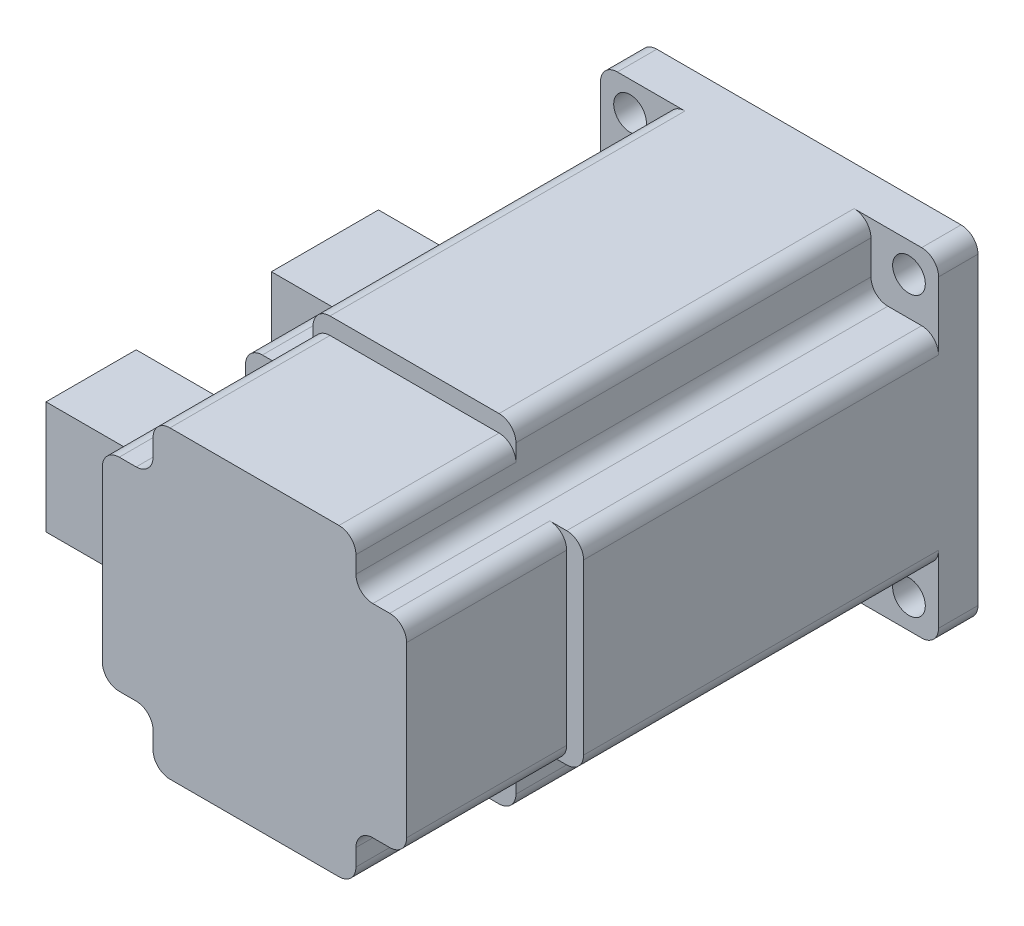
from build123d import *

# Parameters (mm, degrees)
EXTRUDE_1_DEPTH     = 91.4
SKETCH_2_OUTSIDE_W  = 86.944
SKETCH_2_OUTSIDE_H  = 86.944
CUT_EXTRUDE_1_DEPTH = 28.4
EXTRUDE_2_DEPTH     = 7
SKETCH_4_R          = 2.9
CUT_EXTRUDE_2_DEPTH = 7
SKETCH_5_W          = 19
SKETCH_5_H          = 20
SKETCH_5_W_2        = 16
EXTRUDE_3_DEPTH     = 17


with BuildPart() as part:
    # Sketch 1 → Extrude 1 (new body)
    with BuildSketch(Plane.XY):
        with BuildLine():
            Line((23.999999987, -18.000000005), (27, -18.000000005))
            ThreePointArc((27, -18.000000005), (29.121320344, -17.121320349), (30.000000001, -15.000000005))
            Line((30.000000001, -15.000000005), (30.000000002, 15.000000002))
            ThreePointArc((30.000000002, 15.000000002), (29.121320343, 17.121320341), (27.000000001, 17.999999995))
            Line((27.000000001, 17.999999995), (24.000000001, 17.999999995))
            Line((24.000000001, 17.999999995), (21.000000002, 17.999999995))
            ThreePointArc((21.000000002, 17.999999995), (18.878679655, 18.878679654), (18.000000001, 21.000000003))
            Line((18.000000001, 21.000000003), (18.000000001, 23.999999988))
            Line((18.000000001, 23.999999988), (18.000000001, 27))
            ThreePointArc((18.000000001, 27), (17.121320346, 29.121320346), (15.000000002, 30.000000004))
            Line((15.000000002, 30.000000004), (-15.000000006, 30.000000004))
            ThreePointArc((-15.000000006, 30.000000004), (-17.121320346, 29.121320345), (-18.000000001, 27.000000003))
            Line((-18.000000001, 27.000000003), (-18.000000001, 24))
            Line((-18.000000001, 24), (-18.000000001, 21.000000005))
            ThreePointArc((-18.000000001, 21.000000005), (-18.878679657, 18.87867966), (-21.000000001, 18.000000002))
            Line((-21.000000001, 18.000000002), (-23.999999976, 18.000000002))
            Line((-23.999999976, 18.000000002), (-26.999999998, 18.000000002))
            ThreePointArc((-26.999999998, 18.000000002), (-29.121320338, 17.121320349), (-29.999999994, 15.00000001))
            Line((-29.999999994, 15.00000001), (-29.999999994, -15.000000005))
            ThreePointArc((-29.999999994, -15.000000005), (-29.121320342, -17.121320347), (-27, -18.000000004))
            Line((-27, -18.000000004), (-24.000000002, -18.000000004))
            Line((-24.000000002, -18.000000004), (-21.000000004, -18.000000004))
            ThreePointArc((-21.000000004, -18.000000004), (-18.878679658, -18.87867966), (-18.000000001, -21.000000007))
            Line((-18.000000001, -21.000000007), (-18.000000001, -24.000000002))
            Line((-18.000000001, -24.000000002), (-18.000000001, -27.000000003))
            ThreePointArc((-18.000000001, -27.000000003), (-17.121320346, -29.121320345), (-15.000000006, -30.000000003))
            Line((-15.000000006, -30.000000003), (15.000000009, -30.000000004))
            ThreePointArc((15.000000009, -30.000000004), (17.121320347, -29.121320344), (18.000000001, -27.000000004))
            Line((18.000000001, -27.000000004), (18.000000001, -24.000000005))
            Line((18.000000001, -24.000000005), (18.000000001, -21.000000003))
            ThreePointArc((18.000000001, -21.000000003), (18.878679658, -18.878679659), (21.000000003, -18.000000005))
            Line((21.000000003, -18.000000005), (23.999999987, -18.000000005))
        make_face()
    extrude(amount=EXTRUDE_1_DEPTH)

    # Sketch 2 outside → Cut-Extrude 1 (cut)
    with BuildSketch(Plane.XY.offset(91.4)):
        Rectangle(SKETCH_2_OUTSIDE_W, SKETCH_2_OUTSIDE_H)
        with BuildLine():
            Line((-15.000000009, -27.000000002), (15.000000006, -27.000000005))
            ThreePointArc((15.000000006, -27.000000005), (17.121320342, -26.121320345), (17.999999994, -24.000000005))
            Line((17.999999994, -24.000000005), (17.999999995, -21.000000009))
            ThreePointArc((17.999999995, -21.000000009), (18.878679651, -18.878679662), (20.999999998, -18.000000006))
            Line((20.999999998, -18.000000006), (23.999999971, -18.000000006))
            ThreePointArc((23.999999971, -18.000000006), (26.121320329, -17.12132036), (26.999999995, -15.00000001))
            Line((26.999999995, -15.00000001), (26.999999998, 15.000000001))
            ThreePointArc((26.999999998, 15.000000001), (26.12132034, 17.12132034), (23.999999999, 17.999999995))
            Line((23.999999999, 17.999999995), (21, 17.999999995))
            ThreePointArc((21, 17.999999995), (18.878679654, 18.878679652), (17.999999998, 20.999999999))
            Line((17.999999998, 20.999999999), (17.999999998, 23.999999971))
            ThreePointArc((17.999999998, 23.999999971), (17.121320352, 26.121320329), (15.000000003, 26.999999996))
            Line((15.000000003, 26.999999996), (-15.000000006, 26.999999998))
            ThreePointArc((-15.000000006, 26.999999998), (-17.121320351, 26.121320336), (-18.000000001, 23.999999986))
            Line((-18.000000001, 23.999999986), (-18.000000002, 21.000000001))
            ThreePointArc((-18.000000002, 21.000000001), (-18.878679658, 18.878679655), (-21.000000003, 17.999999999))
            Line((-21.000000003, 17.999999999), (-23.999999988, 17.999999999))
            ThreePointArc((-23.999999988, 17.999999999), (-26.121320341, 17.121320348), (-27.000000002, 14.999999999))
            Line((-27.000000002, 14.999999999), (-27.000000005, -15.000000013))
            ThreePointArc((-27.000000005, -15.000000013), (-26.121320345, -17.121320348), (-24.000000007, -18.000000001))
            Line((-24.000000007, -18.000000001), (-21.000000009, -18.000000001))
            ThreePointArc((-21.000000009, -18.000000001), (-18.878679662, -18.878679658), (-18.000000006, -21.000000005))
            Line((-18.000000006, -21.000000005), (-18.000000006, -23.999999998))
            ThreePointArc((-18.000000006, -23.999999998), (-17.121320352, -26.121320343), (-15.000000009, -27.000000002))
        make_face(mode=Mode.SUBTRACT)
    extrude(amount=-CUT_EXTRUDE_1_DEPTH, mode=Mode.SUBTRACT)

    # Sketch 3 → Extrude 2 (add)
    with BuildSketch(Plane(origin=(0, 0, 0), x_dir=(-1, 0, 0), z_dir=(0, 0, -1))):
        with BuildLine():
            Line((-26.999999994, -30.000000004), (26.999999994, -30.000000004))
            ThreePointArc((26.999999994, -30.000000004), (29.121320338, -29.121320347), (29.999999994, -27.000000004))
            Line((29.999999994, -27.000000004), (29.999999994, 27.000000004))
            ThreePointArc((29.999999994, 27.000000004), (29.121320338, 29.121320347), (26.999999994, 30.000000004))
            Line((26.999999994, 30.000000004), (-26.999999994, 30.000000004))
            ThreePointArc((-26.999999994, 30.000000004), (-29.121320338, 29.121320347), (-29.999999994, 27.000000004))
            Line((-29.999999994, 27.000000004), (-29.999999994, -27.000000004))
            ThreePointArc((-29.999999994, -27.000000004), (-29.121320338, -29.121320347), (-26.999999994, -30.000000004))
        make_face()
    extrude(amount=EXTRUDE_2_DEPTH)

    # Sketch 4 → Cut-Extrude 2 (cut)
    with BuildSketch(Plane.XY):
        with Locations((-24.75, 24.75)):
            Circle(SKETCH_4_R)
        with Locations((24.75, 24.75)):
            Circle(SKETCH_4_R)
        with Locations((24.75, -24.75)):
            Circle(SKETCH_4_R)
        with Locations((-24.75, -24.75)):
            Circle(SKETCH_4_R)
    extrude(amount=-CUT_EXTRUDE_2_DEPTH, mode=Mode.SUBTRACT)

    # Sketch 5 → Extrude 3 (add)
    with BuildSketch(Plane.ZY.offset(29.999999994)):
        with Locations((31.9, 0)):
            Rectangle(SKETCH_5_W, SKETCH_5_H)
        with Locations((73.4, 0)):
            Rectangle(SKETCH_5_W_2, SKETCH_5_H)
    extrude(amount=EXTRUDE_3_DEPTH)


with BuildPart() as extrude_3_piece_1:
    # of the separate pieces the step leaves, piece 1, a body of its own (extrude_3_pieces)
    add(part.part.solids().sort_by_distance((26.999999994, -30.000000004, 0))[0])


with BuildPart() as extrude_3_piece_2:
    # of the separate pieces the step leaves, piece 2, a body of its own (extrude_3_pieces)
    add(part.part.solids().sort_by_distance((-29.999999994, -10, 65.4))[0])


solid = Compound([extrude_3_piece_1.part, extrude_3_piece_2.part])
